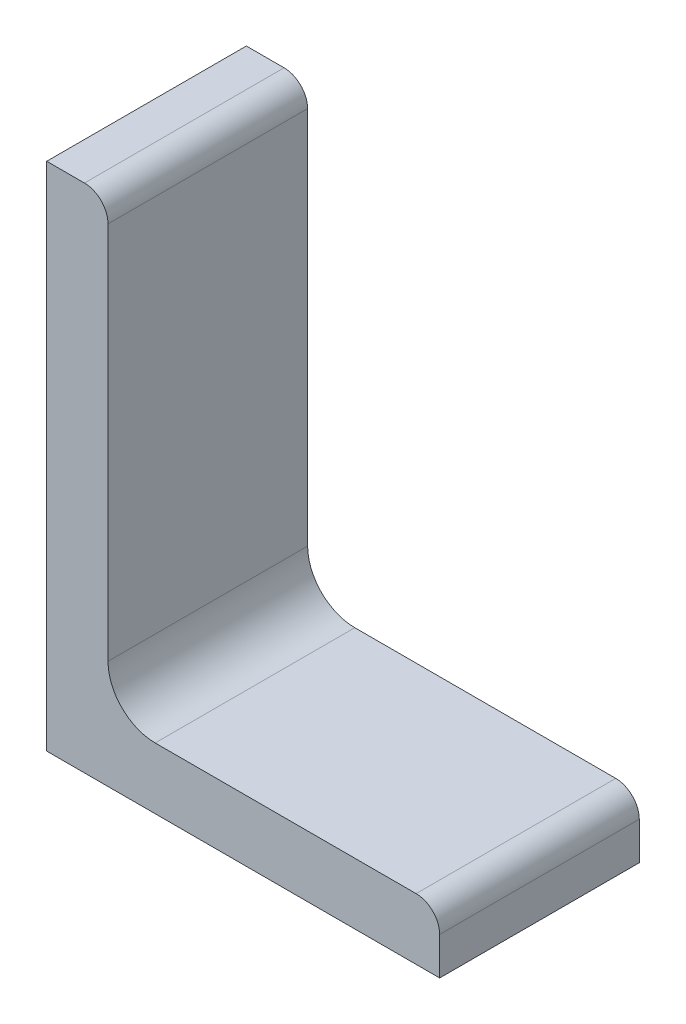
from build123d import *

# Parameters (mm, degrees)
BASESECTION_DEPTH = 12.7


with BuildPart() as part:
    # Sketch1 → BaseSection (new, symmetric)
    with BuildSketch(Plane.XY):
        with BuildLine():
            Line((0, 0), (50, 0))
            Line((50, 0), (50, 4.8))
            ThreePointArc((50, 4.8), (49.121320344, 6.921320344), (47, 7.8))
            Line((47, 7.8), (13.8, 7.8))
            ThreePointArc((13.8, 7.8), (9.557359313, 9.557359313), (7.8, 13.8))
            Line((7.8, 13.8), (7.8, 62))
            ThreePointArc((7.8, 62), (6.921320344, 64.121320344), (4.8, 65))
            Line((4.8, 65), (0, 65))
            Line((0, 65), (0, 0))
        make_face()
    extrude(amount=BASESECTION_DEPTH, both=True)


solid = part.part
